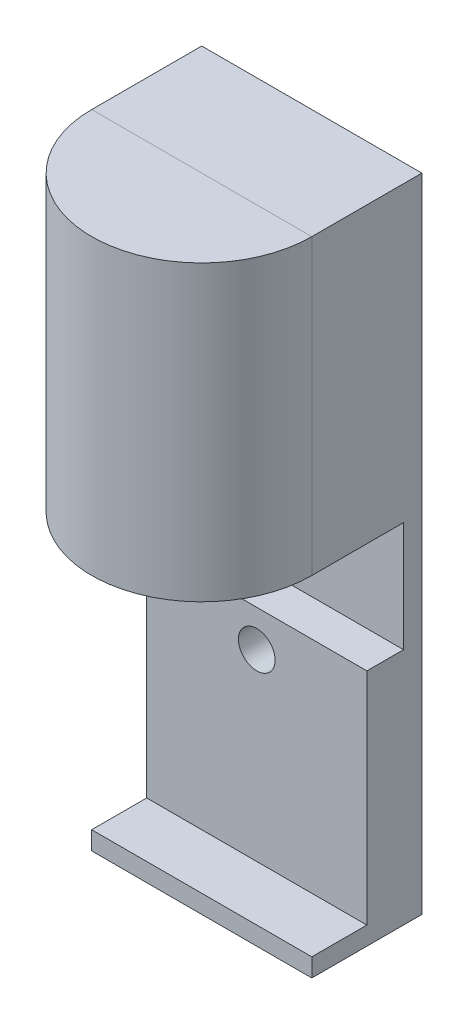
ISO-10303-21;
HEADER;
FILE_DESCRIPTION(('STEP AP214'),'2;1');
FILE_NAME('part.step','',(''),(''),'','','');
FILE_SCHEMA(('AUTOMOTIVE_DESIGN { 1 0 10303 214 1 1 1 1 }'));
ENDSEC;
DATA;
#1=APPLICATION_CONTEXT('core data for automotive mechanical design processes');
#2=APPLICATION_PROTOCOL_DEFINITION('international standard','automotive_design',2000,#1);
#3=PRODUCT_CONTEXT('',#1,'mechanical');
#4=PRODUCT('Part','Part','',(#3));
#5=PRODUCT_RELATED_PRODUCT_CATEGORY('part','',(#4));
#6=PRODUCT_DEFINITION_FORMATION('','',#4);
#7=PRODUCT_DEFINITION_CONTEXT('part definition',#1,'design');
#8=PRODUCT_DEFINITION('design','',#6,#7);
#9=PRODUCT_DEFINITION_SHAPE('','',#8);
#10=(LENGTH_UNIT() NAMED_UNIT(*) SI_UNIT(.MILLI.,.METRE.));
#11=(NAMED_UNIT(*) PLANE_ANGLE_UNIT() SI_UNIT($,.RADIAN.));
#12=(NAMED_UNIT(*) SI_UNIT($,.STERADIAN.) SOLID_ANGLE_UNIT());
#13=UNCERTAINTY_MEASURE_WITH_UNIT(LENGTH_MEASURE(1.E-05),#10,'distance_accuracy_value','');
#14=(GEOMETRIC_REPRESENTATION_CONTEXT(3) GLOBAL_UNCERTAINTY_ASSIGNED_CONTEXT((#13)) GLOBAL_UNIT_ASSIGNED_CONTEXT((#10,
#11,#12)) REPRESENTATION_CONTEXT('',''));
#15=CARTESIAN_POINT('',(0.,0.,0.));
#16=DIRECTION('',(0.,0.,1.));
#17=DIRECTION('',(1.,0.,0.));
#18=AXIS2_PLACEMENT_3D('',#15,#16,#17);
#19=CARTESIAN_POINT('',(0.,0.,0.));
#20=DIRECTION('',(0.,0.,1.));
#21=DIRECTION('',(1.,0.,0.));
#22=AXIS2_PLACEMENT_3D('',#19,#20,#21);
#23=PLANE('',#22);
#24=DIRECTION('',(-1.,0.,0.));
#25=VECTOR('',#24,1.);
#26=CARTESIAN_POINT('',(-60.,0.,0.));
#27=LINE('',#26,#25);
#28=CARTESIAN_POINT('',(60.,0.,0.));
#29=VERTEX_POINT('',#28);
#30=CARTESIAN_POINT('',(50.,0.,0.));
#31=VERTEX_POINT('',#30);
#32=EDGE_CURVE('E181',#29,#31,#27,.T.);
#33=ORIENTED_EDGE('',*,*,#32,.F.);
#34=DIRECTION('',(0.,1.,0.));
#35=VECTOR('',#34,1.);
#36=CARTESIAN_POINT('',(60.,160.,0.));
#37=LINE('',#36,#35);
#38=CARTESIAN_POINT('',(60.,160.,0.));
#39=VERTEX_POINT('',#38);
#40=EDGE_CURVE('E240',#29,#39,#37,.T.);
#41=ORIENTED_EDGE('',*,*,#40,.T.);
#42=DIRECTION('',(-1.,0.,0.));
#43=VECTOR('',#42,1.);
#44=CARTESIAN_POINT('',(-60.,160.,0.));
#45=LINE('',#44,#43);
#46=CARTESIAN_POINT('',(-60.,160.,0.));
#47=VERTEX_POINT('',#46);
#48=EDGE_CURVE('E220',#39,#47,#45,.T.);
#49=ORIENTED_EDGE('',*,*,#48,.T.);
#50=DIRECTION('',(0.,-1.,0.));
#51=VECTOR('',#50,1.);
#52=CARTESIAN_POINT('',(-60.,160.,0.));
#53=LINE('',#52,#51);
#54=CARTESIAN_POINT('',(-60.,0.,0.));
#55=VERTEX_POINT('',#54);
#56=EDGE_CURVE('E232',#47,#55,#53,.T.);
#57=ORIENTED_EDGE('',*,*,#56,.T.);
#58=CARTESIAN_POINT('',(-50.,0.,0.));
#59=VERTEX_POINT('',#58);
#60=EDGE_CURVE('E192',#59,#55,#27,.T.);
#61=ORIENTED_EDGE('',*,*,#60,.F.);
#62=DIRECTION('',(0.,-1.,0.));
#63=VECTOR('',#62,1.);
#64=CARTESIAN_POINT('',(-50.,0.,0.));
#65=LINE('',#64,#63);
#66=CARTESIAN_POINT('',(-50.,150.,0.));
#67=VERTEX_POINT('',#66);
#68=EDGE_CURVE('E264',#67,#59,#65,.T.);
#69=ORIENTED_EDGE('',*,*,#68,.F.);
#70=DIRECTION('',(-1.,0.,0.));
#71=VECTOR('',#70,1.);
#72=CARTESIAN_POINT('',(0.,150.,0.));
#73=LINE('',#72,#71);
#74=CARTESIAN_POINT('',(50.,150.,0.));
#75=VERTEX_POINT('',#74);
#76=EDGE_CURVE('E67',#75,#67,#73,.T.);
#77=ORIENTED_EDGE('',*,*,#76,.F.);
#78=DIRECTION('',(0.,-1.,0.));
#79=VECTOR('',#78,1.);
#80=CARTESIAN_POINT('',(50.,0.,0.));
#81=LINE('',#80,#79);
#82=EDGE_CURVE('E251',#31,#75,#81,.F.);
#83=ORIENTED_EDGE('',*,*,#82,.F.);
#84=EDGE_LOOP('',(#33,#41,#49,#57,#61,#69,#77,#83));
#85=FACE_BOUND('',#84,.T.);
#86=ADVANCED_FACE('F57',(#85),#23,.T.);
#87=CARTESIAN_POINT('',(-60.,160.,-60.));
#88=DIRECTION('',(-1.,0.,0.));
#89=DIRECTION('',(0.,-1.,0.));
#90=AXIS2_PLACEMENT_3D('',#87,#88,#89);
#91=PLANE('',#90);
#92=DIRECTION('',(0.,-1.,0.));
#93=VECTOR('',#92,1.);
#94=CARTESIAN_POINT('',(-60.,160.,-60.));
#95=LINE('',#94,#93);
#96=CARTESIAN_POINT('',(-60.,160.,-60.));
#97=VERTEX_POINT('',#96);
#98=CARTESIAN_POINT('',(-59.9999999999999,-190.,-60.));
#99=VERTEX_POINT('',#98);
#100=EDGE_CURVE('E216',#97,#99,#95,.T.);
#101=ORIENTED_EDGE('',*,*,#100,.T.);
#102=DIRECTION('',(0.,0.,1.));
#103=VECTOR('',#102,1.);
#104=CARTESIAN_POINT('',(-59.9999999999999,-190.,-60.));
#105=LINE('',#104,#103);
#106=CARTESIAN_POINT('',(-59.9999999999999,-190.,0.));
#107=VERTEX_POINT('',#106);
#108=EDGE_CURVE('E231',#99,#107,#105,.T.);
#109=ORIENTED_EDGE('',*,*,#108,.T.);
#110=CARTESIAN_POINT('',(-60.,-180.,0.));
#111=VERTEX_POINT('',#110);
#112=EDGE_CURVE('E215',#111,#107,#53,.T.);
#113=ORIENTED_EDGE('',*,*,#112,.F.);
#114=DIRECTION('',(0.,0.,1.));
#115=VECTOR('',#114,1.);
#116=CARTESIAN_POINT('',(-60.,-180.,-50.));
#117=LINE('',#116,#115);
#118=CARTESIAN_POINT('',(-60.,-180.,-30.));
#119=VERTEX_POINT('',#118);
#120=EDGE_CURVE('E189',#119,#111,#117,.T.);
#121=ORIENTED_EDGE('',*,*,#120,.F.);
#122=DIRECTION('',(0.,-1.,0.));
#123=VECTOR('',#122,1.);
#124=CARTESIAN_POINT('',(-59.9999999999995,-60.,-30.));
#125=LINE('',#124,#123);
#126=CARTESIAN_POINT('',(-59.9999999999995,-60.,-30.));
#127=VERTEX_POINT('',#126);
#128=EDGE_CURVE('E459',#127,#119,#125,.T.);
#129=ORIENTED_EDGE('',*,*,#128,.F.);
#130=DIRECTION('',(0.,0.,1.));
#131=VECTOR('',#130,1.);
#132=CARTESIAN_POINT('',(-59.9999999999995,-60.,-60.));
#133=LINE('',#132,#131);
#134=CARTESIAN_POINT('',(-60.,-60.,-50.));
#135=VERTEX_POINT('',#134);
#136=EDGE_CURVE('E159',#135,#127,#133,.T.);
#137=ORIENTED_EDGE('',*,*,#136,.F.);
#138=DIRECTION('',(0.,-1.,0.));
#139=VECTOR('',#138,1.);
#140=CARTESIAN_POINT('',(-60.,0.,-50.));
#141=LINE('',#140,#139);
#142=CARTESIAN_POINT('',(-60.,0.,-50.));
#143=VERTEX_POINT('',#142);
#144=EDGE_CURVE('E178',#143,#135,#141,.T.);
#145=ORIENTED_EDGE('',*,*,#144,.F.);
#146=DIRECTION('',(0.,0.,1.));
#147=VECTOR('',#146,1.);
#148=CARTESIAN_POINT('',(-60.,0.,-50.));
#149=LINE('',#148,#147);
#150=EDGE_CURVE('E195',#143,#55,#149,.T.);
#151=ORIENTED_EDGE('',*,*,#150,.T.);
#152=ORIENTED_EDGE('',*,*,#56,.F.);
#153=DIRECTION('',(0.,0.,1.));
#154=VECTOR('',#153,1.);
#155=CARTESIAN_POINT('',(-60.,160.,-60.));
#156=LINE('',#155,#154);
#157=EDGE_CURVE('E248',#97,#47,#156,.T.);
#158=ORIENTED_EDGE('',*,*,#157,.F.);
#159=EDGE_LOOP('',(#101,#109,#113,#121,#129,#137,#145,#151,#152,#158));
#160=FACE_BOUND('',#159,.T.);
#161=ADVANCED_FACE('F59',(#160),#91,.T.);
#162=CARTESIAN_POINT('',(-60.,160.,-60.));
#163=DIRECTION('',(0.,1.,0.));
#164=DIRECTION('',(0.,0.,1.));
#165=AXIS2_PLACEMENT_3D('',#162,#163,#164);
#166=PLANE('',#165);
#167=ORIENTED_EDGE('',*,*,#48,.F.);
#168=DIRECTION('',(0.,0.,1.));
#169=VECTOR('',#168,1.);
#170=CARTESIAN_POINT('',(60.,160.,-60.));
#171=LINE('',#170,#169);
#172=CARTESIAN_POINT('',(60.,160.,-60.));
#173=VERTEX_POINT('',#172);
#174=EDGE_CURVE('E252',#173,#39,#171,.T.);
#175=ORIENTED_EDGE('',*,*,#174,.F.);
#176=DIRECTION('',(-1.,0.,0.));
#177=VECTOR('',#176,1.);
#178=CARTESIAN_POINT('',(-60.,160.,-60.));
#179=LINE('',#178,#177);
#180=EDGE_CURVE('E227',#173,#97,#179,.T.);
#181=ORIENTED_EDGE('',*,*,#180,.T.);
#182=ORIENTED_EDGE('',*,*,#157,.T.);
#183=EDGE_LOOP('',(#167,#175,#181,#182));
#184=FACE_BOUND('',#183,.T.);
#185=ADVANCED_FACE('F295',(#184),#166,.T.);
#186=CARTESIAN_POINT('',(60.,160.,-60.));
#187=DIRECTION('',(1.,0.,0.));
#188=DIRECTION('',(0.,1.,0.));
#189=AXIS2_PLACEMENT_3D('',#186,#187,#188);
#190=PLANE('',#189);
#191=DIRECTION('',(0.,1.,0.));
#192=VECTOR('',#191,1.);
#193=CARTESIAN_POINT('',(60.,160.,-60.));
#194=LINE('',#193,#192);
#195=CARTESIAN_POINT('',(60.,-190.,-60.));
#196=VERTEX_POINT('',#195);
#197=EDGE_CURVE('E224',#196,#173,#194,.T.);
#198=ORIENTED_EDGE('',*,*,#197,.T.);
#199=ORIENTED_EDGE('',*,*,#174,.T.);
#200=ORIENTED_EDGE('',*,*,#40,.F.);
#201=DIRECTION('',(0.,0.,1.));
#202=VECTOR('',#201,1.);
#203=CARTESIAN_POINT('',(60.,0.,-50.));
#204=LINE('',#203,#202);
#205=CARTESIAN_POINT('',(60.,0.,-50.));
#206=VERTEX_POINT('',#205);
#207=EDGE_CURVE('E200',#206,#29,#204,.T.);
#208=ORIENTED_EDGE('',*,*,#207,.F.);
#209=DIRECTION('',(0.,1.,0.));
#210=VECTOR('',#209,1.);
#211=CARTESIAN_POINT('',(60.,0.,-50.));
#212=LINE('',#211,#210);
#213=CARTESIAN_POINT('',(60.0000000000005,-60.,-50.));
#214=VERTEX_POINT('',#213);
#215=EDGE_CURVE('E154',#214,#206,#212,.T.);
#216=ORIENTED_EDGE('',*,*,#215,.F.);
#217=DIRECTION('',(0.,0.,1.));
#218=VECTOR('',#217,1.);
#219=CARTESIAN_POINT('',(60.0000000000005,-60.,-60.));
#220=LINE('',#219,#218);
#221=CARTESIAN_POINT('',(60.0000000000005,-60.,-30.));
#222=VERTEX_POINT('',#221);
#223=EDGE_CURVE('E149',#214,#222,#220,.T.);
#224=ORIENTED_EDGE('',*,*,#223,.T.);
#225=DIRECTION('',(0.,1.,0.));
#226=VECTOR('',#225,1.);
#227=CARTESIAN_POINT('',(60.0000000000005,-60.,-30.));
#228=LINE('',#227,#226);
#229=CARTESIAN_POINT('',(60.,-180.,-30.));
#230=VERTEX_POINT('',#229);
#231=EDGE_CURVE('E152',#230,#222,#228,.T.);
#232=ORIENTED_EDGE('',*,*,#231,.F.);
#233=DIRECTION('',(0.,0.,1.));
#234=VECTOR('',#233,1.);
#235=CARTESIAN_POINT('',(60.,-180.,-50.));
#236=LINE('',#235,#234);
#237=CARTESIAN_POINT('',(60.,-180.,0.));
#238=VERTEX_POINT('',#237);
#239=EDGE_CURVE('E79',#230,#238,#236,.T.);
#240=ORIENTED_EDGE('',*,*,#239,.T.);
#241=CARTESIAN_POINT('',(60.,-190.,0.));
#242=VERTEX_POINT('',#241);
#243=EDGE_CURVE('E241',#242,#238,#37,.T.);
#244=ORIENTED_EDGE('',*,*,#243,.F.);
#245=DIRECTION('',(0.,0.,1.));
#246=VECTOR('',#245,1.);
#247=CARTESIAN_POINT('',(60.,-190.,-60.));
#248=LINE('',#247,#246);
#249=EDGE_CURVE('E256',#196,#242,#248,.T.);
#250=ORIENTED_EDGE('',*,*,#249,.F.);
#251=EDGE_LOOP('',(#198,#199,#200,#208,#216,#224,#232,#240,#244,#250));
#252=FACE_BOUND('',#251,.T.);
#253=ADVANCED_FACE('F151',(#252),#190,.T.);
#254=CARTESIAN_POINT('',(-59.9999999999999,-190.,-60.));
#255=DIRECTION('',(0.,-1.,0.));
#256=DIRECTION('',(0.,0.,-1.));
#257=AXIS2_PLACEMENT_3D('',#254,#255,#256);
#258=PLANE('',#257);
#259=DIRECTION('',(1.,0.,0.));
#260=VECTOR('',#259,1.);
#261=CARTESIAN_POINT('',(-59.9999999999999,-190.,0.));
#262=LINE('',#261,#260);
#263=EDGE_CURVE('E236',#107,#242,#262,.T.);
#264=ORIENTED_EDGE('',*,*,#263,.F.);
#265=ORIENTED_EDGE('',*,*,#108,.F.);
#266=DIRECTION('',(1.,0.,0.));
#267=VECTOR('',#266,1.);
#268=CARTESIAN_POINT('',(-59.9999999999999,-190.,-60.));
#269=LINE('',#268,#267);
#270=EDGE_CURVE('E219',#99,#196,#269,.T.);
#271=ORIENTED_EDGE('',*,*,#270,.T.);
#272=ORIENTED_EDGE('',*,*,#249,.T.);
#273=EDGE_LOOP('',(#264,#265,#271,#272));
#274=FACE_BOUND('',#273,.T.);
#275=ADVANCED_FACE('F332',(#274),#258,.T.);
#276=CARTESIAN_POINT('',(0.,0.,-60.));
#277=DIRECTION('',(0.,0.,1.));
#278=DIRECTION('',(1.,0.,0.));
#279=AXIS2_PLACEMENT_3D('',#276,#277,#278);
#280=PLANE('',#279);
#281=CARTESIAN_POINT('',(0.,-80.,-60.));
#282=DIRECTION('',(0.,0.,1.));
#283=DIRECTION('',(1.,0.,0.));
#284=AXIS2_PLACEMENT_3D('',#281,#282,#283);
#285=CIRCLE('',#284,10.);
#286=CARTESIAN_POINT('',(10.,-80.,-60.));
#287=VERTEX_POINT('',#286);
#288=EDGE_CURVE('E457',#287,#287,#285,.T.);
#289=ORIENTED_EDGE('',*,*,#288,.T.);
#290=EDGE_LOOP('',(#289));
#291=FACE_BOUND('',#290,.T.);
#292=ORIENTED_EDGE('',*,*,#270,.F.);
#293=ORIENTED_EDGE('',*,*,#100,.F.);
#294=ORIENTED_EDGE('',*,*,#180,.F.);
#295=ORIENTED_EDGE('',*,*,#197,.F.);
#296=EDGE_LOOP('',(#292,#293,#294,#295));
#297=FACE_BOUND('',#296,.T.);
#298=ADVANCED_FACE('F325',(#291,#297),#280,.F.);
#299=DIRECTION('',(1.,0.,0.));
#300=VECTOR('',#299,1.);
#301=CARTESIAN_POINT('',(-60.,-180.,0.));
#302=LINE('',#301,#300);
#303=EDGE_CURVE('E176',#111,#238,#302,.T.);
#304=ORIENTED_EDGE('',*,*,#303,.F.);
#305=ORIENTED_EDGE('',*,*,#112,.T.);
#306=ORIENTED_EDGE('',*,*,#263,.T.);
#307=ORIENTED_EDGE('',*,*,#243,.T.);
#308=EDGE_LOOP('',(#304,#305,#306,#307));
#309=FACE_BOUND('',#308,.T.);
#310=ADVANCED_FACE('F318',(#309),#23,.T.);
#311=CARTESIAN_POINT('',(0.,150.,0.));
#312=DIRECTION('',(0.,1.,0.));
#313=DIRECTION('',(0.,0.,1.));
#314=AXIS2_PLACEMENT_3D('',#311,#312,#313);
#315=PLANE('',#314);
#316=ORIENTED_EDGE('',*,*,#76,.T.);
#317=CARTESIAN_POINT('',(0.,150.,0.));
#318=DIRECTION('',(0.,-1.,0.));
#319=DIRECTION('',(0.,0.,-1.));
#320=AXIS2_PLACEMENT_3D('',#317,#318,#319);
#321=CIRCLE('',#320,50.);
#322=EDGE_CURVE('E211',#67,#75,#321,.T.);
#323=ORIENTED_EDGE('',*,*,#322,.T.);
#324=EDGE_LOOP('',(#316,#323));
#325=FACE_BOUND('',#324,.T.);
#326=ADVANCED_FACE('F272',(#325),#315,.F.);
#327=CARTESIAN_POINT('',(0.,0.,0.));
#328=DIRECTION('',(0.,-1.,0.));
#329=DIRECTION('',(0.,0.,-1.));
#330=AXIS2_PLACEMENT_3D('',#327,#328,#329);
#331=CYLINDRICAL_SURFACE('',#330,50.);
#332=ORIENTED_EDGE('',*,*,#68,.T.);
#333=CARTESIAN_POINT('',(0.,0.,0.));
#334=DIRECTION('',(0.,-1.,0.));
#335=DIRECTION('',(0.,0.,-1.));
#336=AXIS2_PLACEMENT_3D('',#333,#334,#335);
#337=CIRCLE('',#336,50.);
#338=CARTESIAN_POINT('',(0.,0.,-50.));
#339=VERTEX_POINT('',#338);
#340=EDGE_CURVE('E207',#59,#339,#337,.T.);
#341=ORIENTED_EDGE('',*,*,#340,.T.);
#342=EDGE_CURVE('E199',#339,#31,#337,.T.);
#343=ORIENTED_EDGE('',*,*,#342,.T.);
#344=ORIENTED_EDGE('',*,*,#82,.T.);
#345=ORIENTED_EDGE('',*,*,#322,.F.);
#346=EDGE_LOOP('',(#332,#341,#343,#344,#345));
#347=FACE_BOUND('',#346,.T.);
#348=ADVANCED_FACE('F277',(#347),#331,.F.);
#349=CARTESIAN_POINT('',(-60.,0.,-50.));
#350=DIRECTION('',(0.,1.,0.));
#351=DIRECTION('',(0.,0.,1.));
#352=AXIS2_PLACEMENT_3D('',#349,#350,#351);
#353=PLANE('',#352);
#354=ORIENTED_EDGE('',*,*,#60,.T.);
#355=ORIENTED_EDGE('',*,*,#150,.F.);
#356=DIRECTION('',(-1.,0.,0.));
#357=VECTOR('',#356,1.);
#358=CARTESIAN_POINT('',(-60.,0.,-50.));
#359=LINE('',#358,#357);
#360=EDGE_CURVE('E184',#339,#143,#359,.T.);
#361=ORIENTED_EDGE('',*,*,#360,.F.);
#362=ORIENTED_EDGE('',*,*,#340,.F.);
#363=EDGE_LOOP('',(#354,#355,#361,#362));
#364=FACE_BOUND('',#363,.T.);
#365=ADVANCED_FACE('F300',(#364),#353,.F.);
#366=EDGE_CURVE('E185',#206,#339,#359,.T.);
#367=ORIENTED_EDGE('',*,*,#366,.F.);
#368=ORIENTED_EDGE('',*,*,#207,.T.);
#369=ORIENTED_EDGE('',*,*,#32,.T.);
#370=ORIENTED_EDGE('',*,*,#342,.F.);
#371=EDGE_LOOP('',(#367,#368,#369,#370));
#372=FACE_BOUND('',#371,.T.);
#373=ADVANCED_FACE('F305',(#372),#353,.F.);
#374=CARTESIAN_POINT('',(-60.,-180.,-50.));
#375=DIRECTION('',(0.,-1.,0.));
#376=DIRECTION('',(0.,0.,-1.));
#377=AXIS2_PLACEMENT_3D('',#374,#375,#376);
#378=PLANE('',#377);
#379=ORIENTED_EDGE('',*,*,#239,.F.);
#380=DIRECTION('',(1.,0.,0.));
#381=VECTOR('',#380,1.);
#382=CARTESIAN_POINT('',(-59.9999999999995,-180.,-30.));
#383=LINE('',#382,#381);
#384=EDGE_CURVE('E74',#119,#230,#383,.T.);
#385=ORIENTED_EDGE('',*,*,#384,.F.);
#386=ORIENTED_EDGE('',*,*,#120,.T.);
#387=ORIENTED_EDGE('',*,*,#303,.T.);
#388=EDGE_LOOP('',(#379,#385,#386,#387));
#389=FACE_BOUND('',#388,.T.);
#390=ADVANCED_FACE('F307',(#389),#378,.F.);
#391=CARTESIAN_POINT('',(0.,0.,-50.));
#392=DIRECTION('',(0.,0.,1.));
#393=DIRECTION('',(1.,0.,0.));
#394=AXIS2_PLACEMENT_3D('',#391,#392,#393);
#395=PLANE('',#394);
#396=DIRECTION('',(-1.,0.,0.));
#397=VECTOR('',#396,1.);
#398=CARTESIAN_POINT('',(0.,-60.,-50.));
#399=LINE('',#398,#397);
#400=EDGE_CURVE('E12',#214,#135,#399,.T.);
#401=ORIENTED_EDGE('',*,*,#400,.F.);
#402=ORIENTED_EDGE('',*,*,#215,.T.);
#403=ORIENTED_EDGE('',*,*,#366,.T.);
#404=ORIENTED_EDGE('',*,*,#360,.T.);
#405=ORIENTED_EDGE('',*,*,#144,.T.);
#406=EDGE_LOOP('',(#401,#402,#403,#404,#405));
#407=FACE_BOUND('',#406,.T.);
#408=ADVANCED_FACE('F303',(#407),#395,.T.);
#409=CARTESIAN_POINT('',(-59.9999999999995,-60.,-60.));
#410=DIRECTION('',(0.,1.,0.));
#411=DIRECTION('',(0.,0.,1.));
#412=AXIS2_PLACEMENT_3D('',#409,#410,#411);
#413=PLANE('',#412);
#414=ORIENTED_EDGE('',*,*,#223,.F.);
#415=ORIENTED_EDGE('',*,*,#400,.T.);
#416=ORIENTED_EDGE('',*,*,#136,.T.);
#417=DIRECTION('',(-1.,0.,0.));
#418=VECTOR('',#417,1.);
#419=CARTESIAN_POINT('',(-59.9999999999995,-60.,-30.));
#420=LINE('',#419,#418);
#421=EDGE_CURVE('E160',#222,#127,#420,.T.);
#422=ORIENTED_EDGE('',*,*,#421,.F.);
#423=EDGE_LOOP('',(#414,#415,#416,#422));
#424=FACE_BOUND('',#423,.T.);
#425=ADVANCED_FACE('F168',(#424),#413,.T.);
#426=CARTESIAN_POINT('',(0.,0.,-30.));
#427=DIRECTION('',(0.,0.,1.));
#428=DIRECTION('',(1.,0.,0.));
#429=AXIS2_PLACEMENT_3D('',#426,#427,#428);
#430=PLANE('',#429);
#431=CARTESIAN_POINT('',(0.,-80.,-30.));
#432=DIRECTION('',(0.,0.,1.));
#433=DIRECTION('',(1.,0.,0.));
#434=AXIS2_PLACEMENT_3D('',#431,#432,#433);
#435=CIRCLE('',#434,10.);
#436=CARTESIAN_POINT('',(10.,-80.,-30.));
#437=VERTEX_POINT('',#436);
#438=EDGE_CURVE('E61',#437,#437,#435,.T.);
#439=ORIENTED_EDGE('',*,*,#438,.F.);
#440=EDGE_LOOP('',(#439));
#441=FACE_BOUND('',#440,.T.);
#442=ORIENTED_EDGE('',*,*,#128,.T.);
#443=ORIENTED_EDGE('',*,*,#384,.T.);
#444=ORIENTED_EDGE('',*,*,#231,.T.);
#445=ORIENTED_EDGE('',*,*,#421,.T.);
#446=EDGE_LOOP('',(#442,#443,#444,#445));
#447=FACE_BOUND('',#446,.T.);
#448=ADVANCED_FACE('F165',(#441,#447),#430,.T.);
#449=CARTESIAN_POINT('',(0.,-80.,-70.));
#450=DIRECTION('',(0.,0.,1.));
#451=DIRECTION('',(1.,0.,0.));
#452=AXIS2_PLACEMENT_3D('',#449,#450,#451);
#453=CYLINDRICAL_SURFACE('',#452,10.);
#454=ORIENTED_EDGE('',*,*,#438,.T.);
#455=EDGE_LOOP('',(#454));
#456=FACE_BOUND('',#455,.T.);
#457=ORIENTED_EDGE('',*,*,#288,.F.);
#458=EDGE_LOOP('',(#457));
#459=FACE_BOUND('',#458,.T.);
#460=ADVANCED_FACE('F439',(#456,#459),#453,.F.);
#461=CLOSED_SHELL('',(#86,#161,#185,#253,#275,#298,#310,#326,#348,#365,#373,#390,#408,#425,#448,#460));
#462=MANIFOLD_SOLID_BREP('B2',#461);
#463=CARTESIAN_POINT('',(0.,160.,0.));
#464=DIRECTION('',(0.,-1.,0.));
#465=DIRECTION('',(0.,0.,-1.));
#466=AXIS2_PLACEMENT_3D('',#463,#464,#465);
#467=PLANE('',#466);
#468=CARTESIAN_POINT('',(0.,160.,0.));
#469=DIRECTION('',(0.,1.,0.));
#470=DIRECTION('',(0.,0.,1.));
#471=AXIS2_PLACEMENT_3D('',#468,#469,#470);
#472=CIRCLE('',#471,60.);
#473=CARTESIAN_POINT('',(-60.,160.,-4.18977760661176E-13));
#474=VERTEX_POINT('',#473);
#475=CARTESIAN_POINT('',(60.,160.,0.));
#476=VERTEX_POINT('',#475);
#477=EDGE_CURVE('E490',#474,#476,#472,.T.);
#478=ORIENTED_EDGE('',*,*,#477,.T.);
#479=DIRECTION('',(1.,0.,0.));
#480=VECTOR('',#479,1.);
#481=CARTESIAN_POINT('',(0.,160.,0.));
#482=LINE('',#481,#480);
#483=EDGE_CURVE('E529',#474,#476,#482,.T.);
#484=ORIENTED_EDGE('',*,*,#483,.F.);
#485=EDGE_LOOP('',(#478,#484));
#486=FACE_BOUND('',#485,.T.);
#487=ADVANCED_FACE('F468',(#486),#467,.F.);
#488=CARTESIAN_POINT('',(0.,0.,0.));
#489=DIRECTION('',(0.,1.,0.));
#490=DIRECTION('',(0.,0.,1.));
#491=AXIS2_PLACEMENT_3D('',#488,#489,#490);
#492=CYLINDRICAL_SURFACE('',#491,60.);
#493=CARTESIAN_POINT('',(0.,0.,0.));
#494=DIRECTION('',(0.,1.,0.));
#495=DIRECTION('',(0.,0.,1.));
#496=AXIS2_PLACEMENT_3D('',#493,#494,#495);
#497=CIRCLE('',#496,60.);
#498=CARTESIAN_POINT('',(-60.,0.,-4.18977760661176E-13));
#499=VERTEX_POINT('',#498);
#500=CARTESIAN_POINT('',(60.,0.,0.));
#501=VERTEX_POINT('',#500);
#502=EDGE_CURVE('E535',#499,#501,#497,.T.);
#503=ORIENTED_EDGE('',*,*,#502,.T.);
#504=DIRECTION('',(0.,1.,0.));
#505=VECTOR('',#504,1.);
#506=CARTESIAN_POINT('',(60.,0.,0.));
#507=LINE('',#506,#505);
#508=EDGE_CURVE('E526',#501,#476,#507,.T.);
#509=ORIENTED_EDGE('',*,*,#508,.T.);
#510=ORIENTED_EDGE('',*,*,#477,.F.);
#511=DIRECTION('',(0.,1.,0.));
#512=VECTOR('',#511,1.);
#513=CARTESIAN_POINT('',(-60.,0.,-4.18977760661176E-13));
#514=LINE('',#513,#512);
#515=EDGE_CURVE('E527',#499,#474,#514,.T.);
#516=ORIENTED_EDGE('',*,*,#515,.F.);
#517=EDGE_LOOP('',(#503,#509,#510,#516));
#518=FACE_BOUND('',#517,.T.);
#519=ADVANCED_FACE('F539',(#518),#492,.T.);
#520=CARTESIAN_POINT('',(0.,0.,0.));
#521=DIRECTION('',(0.,1.,0.));
#522=DIRECTION('',(0.,0.,1.));
#523=AXIS2_PLACEMENT_3D('',#520,#521,#522);
#524=PLANE('',#523);
#525=DIRECTION('',(-1.,0.,0.));
#526=VECTOR('',#525,1.);
#527=CARTESIAN_POINT('',(0.,0.,0.));
#528=LINE('',#527,#526);
#529=CARTESIAN_POINT('',(-50.,0.,-3.49148133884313E-13));
#530=VERTEX_POINT('',#529);
#531=EDGE_CURVE('E522',#530,#499,#528,.T.);
#532=ORIENTED_EDGE('',*,*,#531,.F.);
#533=CARTESIAN_POINT('',(0.,0.,0.));
#534=DIRECTION('',(0.,-1.,0.));
#535=DIRECTION('',(0.,0.,-1.));
#536=AXIS2_PLACEMENT_3D('',#533,#534,#535);
#537=CIRCLE('',#536,50.);
#538=CARTESIAN_POINT('',(50.,0.,3.49148133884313E-13));
#539=VERTEX_POINT('',#538);
#540=EDGE_CURVE('E511',#539,#530,#537,.T.);
#541=ORIENTED_EDGE('',*,*,#540,.F.);
#542=EDGE_CURVE('E520',#501,#539,#528,.T.);
#543=ORIENTED_EDGE('',*,*,#542,.F.);
#544=ORIENTED_EDGE('',*,*,#502,.F.);
#545=EDGE_LOOP('',(#532,#541,#543,#544));
#546=FACE_BOUND('',#545,.T.);
#547=ADVANCED_FACE('F518',(#546),#524,.F.);
#548=CARTESIAN_POINT('',(0.,0.,0.));
#549=DIRECTION('',(0.,0.,1.));
#550=DIRECTION('',(1.,0.,0.));
#551=AXIS2_PLACEMENT_3D('',#548,#549,#550);
#552=PLANE('',#551);
#553=DIRECTION('',(-1.,0.,0.));
#554=VECTOR('',#553,1.);
#555=CARTESIAN_POINT('',(0.,150.,0.));
#556=LINE('',#555,#554);
#557=CARTESIAN_POINT('',(50.,150.,3.49148133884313E-13));
#558=VERTEX_POINT('',#557);
#559=CARTESIAN_POINT('',(-50.,150.,-3.49148133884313E-13));
#560=VERTEX_POINT('',#559);
#561=EDGE_CURVE('E475',#558,#560,#556,.T.);
#562=ORIENTED_EDGE('',*,*,#561,.T.);
#563=DIRECTION('',(0.,-1.,0.));
#564=VECTOR('',#563,1.);
#565=CARTESIAN_POINT('',(-50.,0.,-3.49148133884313E-13));
#566=LINE('',#565,#564);
#567=EDGE_CURVE('E55',#560,#530,#566,.T.);
#568=ORIENTED_EDGE('',*,*,#567,.T.);
#569=ORIENTED_EDGE('',*,*,#531,.T.);
#570=ORIENTED_EDGE('',*,*,#515,.T.);
#571=ORIENTED_EDGE('',*,*,#483,.T.);
#572=ORIENTED_EDGE('',*,*,#508,.F.);
#573=ORIENTED_EDGE('',*,*,#542,.T.);
#574=DIRECTION('',(0.,-1.,0.));
#575=VECTOR('',#574,1.);
#576=CARTESIAN_POINT('',(50.,0.,3.49148133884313E-13));
#577=LINE('',#576,#575);
#578=EDGE_CURVE('E508',#539,#558,#577,.F.);
#579=ORIENTED_EDGE('',*,*,#578,.T.);
#580=EDGE_LOOP('',(#562,#568,#569,#570,#571,#572,#573,#579));
#581=FACE_BOUND('',#580,.T.);
#582=ADVANCED_FACE('F525',(#581),#552,.F.);
#583=CARTESIAN_POINT('',(0.,150.,0.));
#584=DIRECTION('',(0.,1.,0.));
#585=DIRECTION('',(0.,0.,1.));
#586=AXIS2_PLACEMENT_3D('',#583,#584,#585);
#587=PLANE('',#586);
#588=CARTESIAN_POINT('',(0.,150.,0.));
#589=DIRECTION('',(0.,-1.,0.));
#590=DIRECTION('',(0.,0.,-1.));
#591=AXIS2_PLACEMENT_3D('',#588,#589,#590);
#592=CIRCLE('',#591,50.);
#593=EDGE_CURVE('E482',#558,#560,#592,.T.);
#594=ORIENTED_EDGE('',*,*,#593,.T.);
#595=ORIENTED_EDGE('',*,*,#561,.F.);
#596=EDGE_LOOP('',(#594,#595));
#597=FACE_BOUND('',#596,.T.);
#598=ADVANCED_FACE('F538',(#597),#587,.F.);
#599=CARTESIAN_POINT('',(0.,0.,0.));
#600=DIRECTION('',(0.,-1.,0.));
#601=DIRECTION('',(0.,0.,-1.));
#602=AXIS2_PLACEMENT_3D('',#599,#600,#601);
#603=CYLINDRICAL_SURFACE('',#602,50.);
#604=ORIENTED_EDGE('',*,*,#593,.F.);
#605=ORIENTED_EDGE('',*,*,#578,.F.);
#606=ORIENTED_EDGE('',*,*,#540,.T.);
#607=ORIENTED_EDGE('',*,*,#567,.F.);
#608=EDGE_LOOP('',(#604,#605,#606,#607));
#609=FACE_BOUND('',#608,.T.);
#610=ADVANCED_FACE('F510',(#609),#603,.F.);
#611=CLOSED_SHELL('',(#487,#519,#547,#582,#598,#610));
#612=MANIFOLD_SOLID_BREP('B6',#611);
#613=ADVANCED_BREP_SHAPE_REPRESENTATION('',(#18,#462,#612),#14);
#614=SHAPE_DEFINITION_REPRESENTATION(#9,#613);
ENDSEC;
END-ISO-10303-21;
